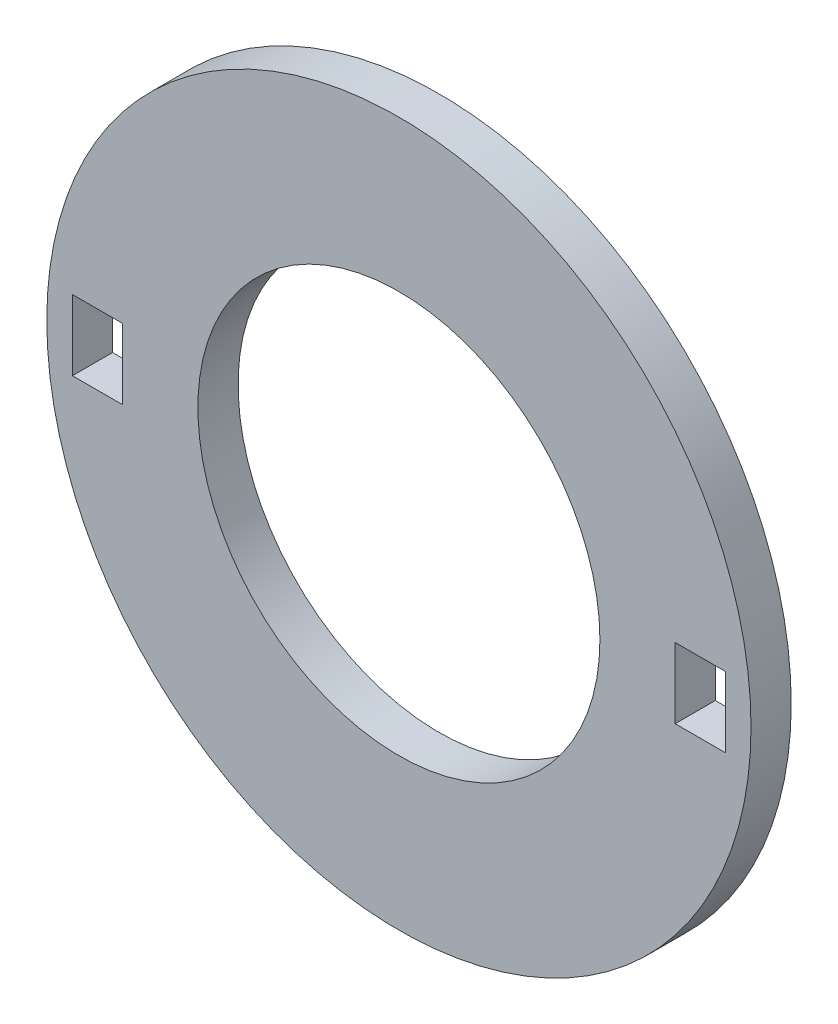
from build123d import *

# Parameters (mm, degrees)
SKETCH1_R           = 35.033405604
SKETCH1_R_2         = 20
SKETCH1_W           = 5
SKETCH1_H           = 7
BOSS_EXTRUDE6_DEPTH = 4


with BuildPart() as part:
    # Sketch1 → Boss-Extrude6 (new body)
    with BuildSketch(Plane.XY):
        Circle(SKETCH1_R)
        Circle(SKETCH1_R_2, mode=Mode.SUBTRACT)
        with Locations((29.984277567, 0)):
            Rectangle(SKETCH1_W, SKETCH1_H, mode=Mode.SUBTRACT)
        with Locations((-29.984277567, 0)):
            Rectangle(SKETCH1_W, SKETCH1_H, mode=Mode.SUBTRACT)
    extrude(amount=BOSS_EXTRUDE6_DEPTH)


solid = part.part
